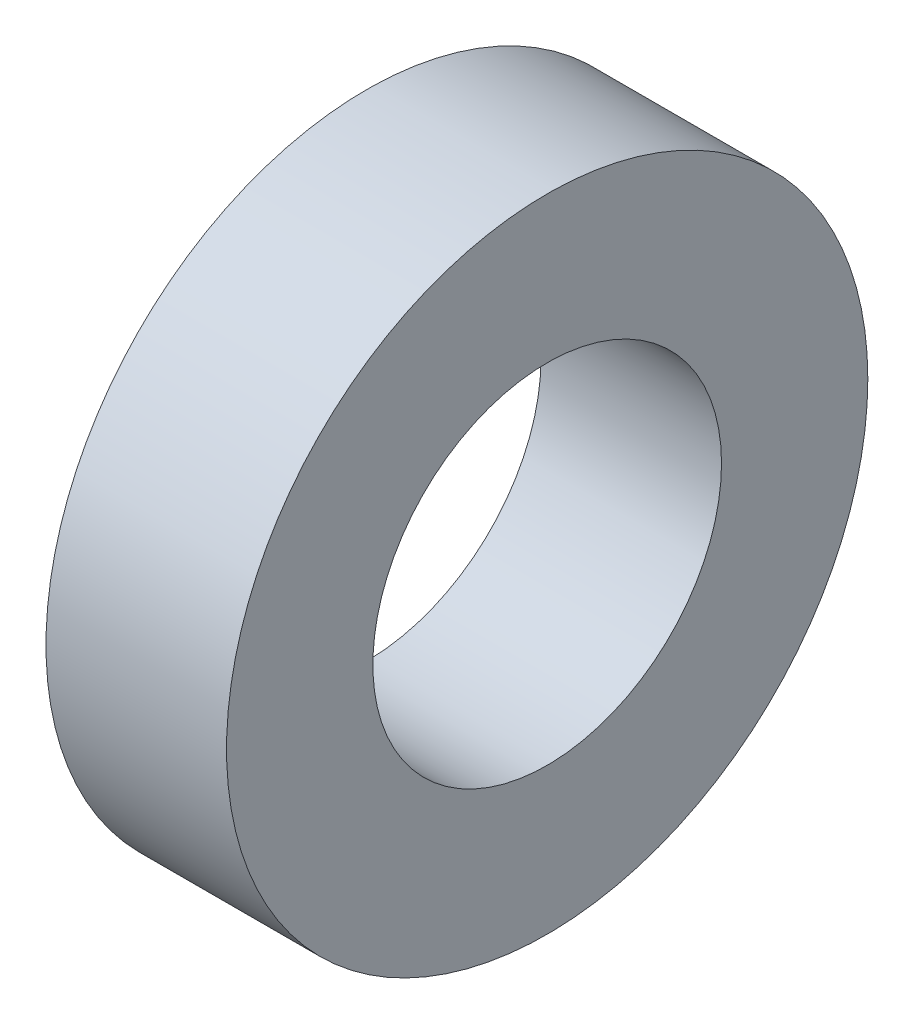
from build123d import *

# Parameters (mm, degrees)
SKETCH1_R           = 2.6162
SKETCH1_R_2         = 1.4224
BOSS_EXTRUDE1_DEPTH = 1.4732


with BuildPart() as part:
    # Sketch1 → Boss-Extrude1 (new body)
    with BuildSketch(Plane(origin=(0, 0, 0), x_dir=(0, 0, -1), z_dir=(1, 0, 0))):
        Circle(SKETCH1_R)
        Circle(SKETCH1_R_2, mode=Mode.SUBTRACT)
    extrude(amount=BOSS_EXTRUDE1_DEPTH)


solid = part.part
